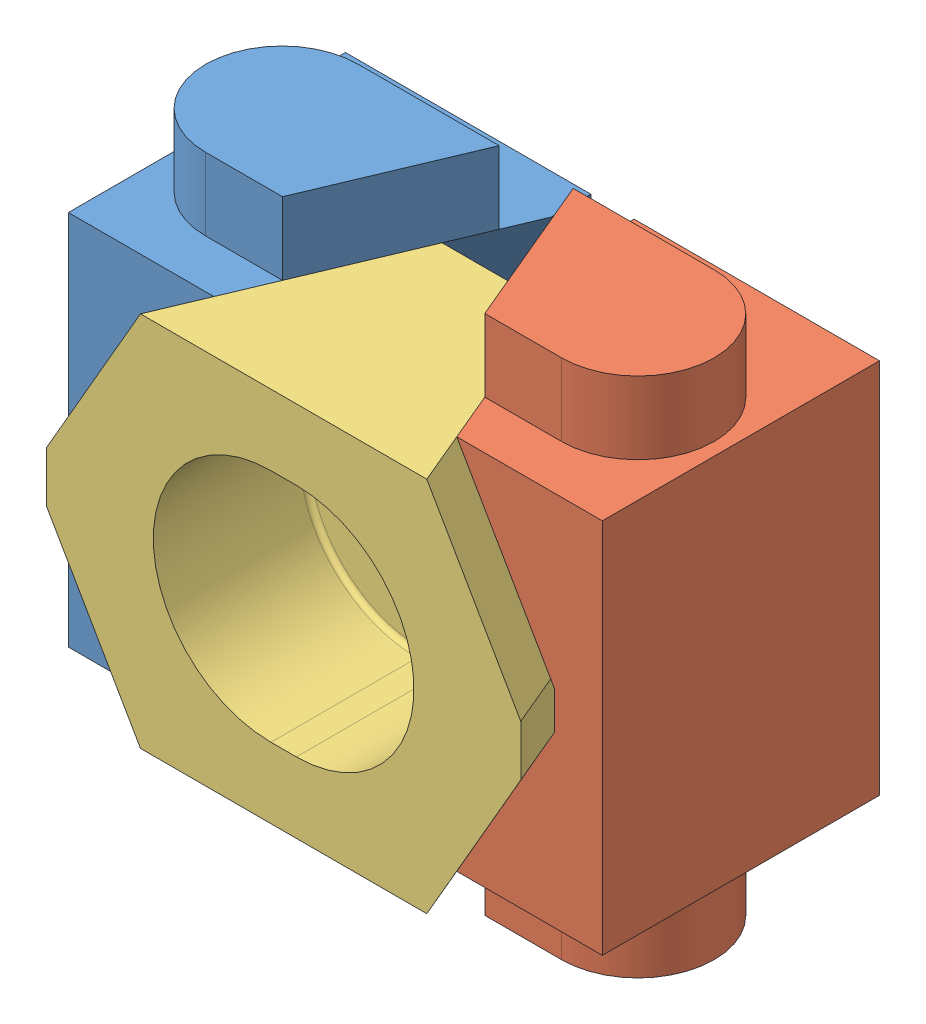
SolidWorks assembly DK2-VT-TC.sldasm, configuration Default (file format 15000). Lengths in mm.
Overall size (42 41 25.87).
3 component instances, 3 part files, 0 mates.
Components (placement in the parent):
- dk2-vt-TC_01-1: dk2-vt-TC_01.SLDPRT [Default] at (-21 0 0) size (19.3 41 21.8)
- dk2-vt-TC_02-1: dk2-vt-TC_02.SLDPRT [Default] at (21 0 0) x (-1 0 0) z (0 0 1) size (19.3 41 21.8)
- dk2-vt-TC_03-1: dk2-vt-TC_03.SLDPRT [Default] at (0 0 9.1653) size (37.3 29.6 16.7)
